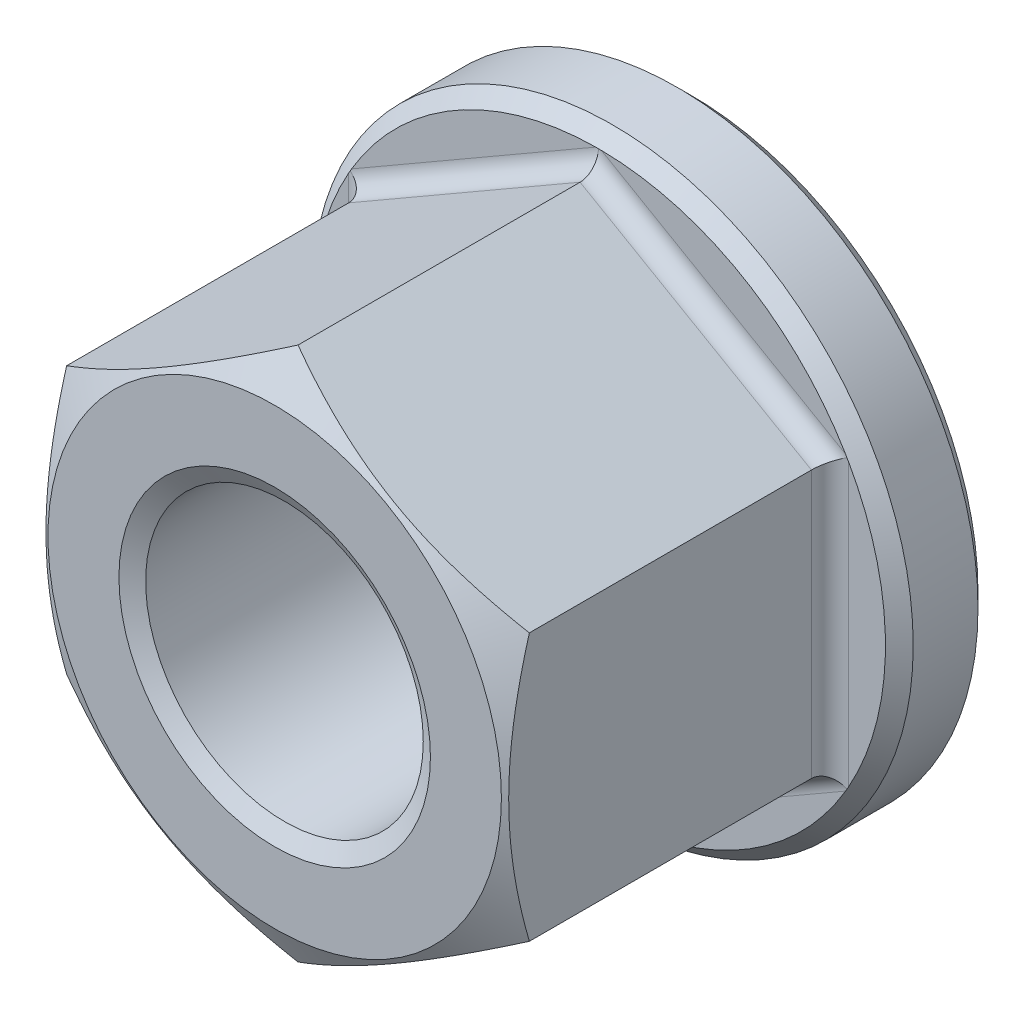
ISO-10303-21;
HEADER;
FILE_DESCRIPTION(('STEP AP214'),'2;1');
FILE_NAME('part.step','',(''),(''),'','','');
FILE_SCHEMA(('AUTOMOTIVE_DESIGN { 1 0 10303 214 1 1 1 1 }'));
ENDSEC;
DATA;
#1=APPLICATION_CONTEXT('core data for automotive mechanical design processes');
#2=APPLICATION_PROTOCOL_DEFINITION('international standard','automotive_design',2000,#1);
#3=PRODUCT_CONTEXT('',#1,'mechanical');
#4=PRODUCT('Part','Part','',(#3));
#5=PRODUCT_RELATED_PRODUCT_CATEGORY('part','',(#4));
#6=PRODUCT_DEFINITION_FORMATION('','',#4);
#7=PRODUCT_DEFINITION_CONTEXT('part definition',#1,'design');
#8=PRODUCT_DEFINITION('design','',#6,#7);
#9=PRODUCT_DEFINITION_SHAPE('','',#8);
#10=(LENGTH_UNIT() NAMED_UNIT(*) SI_UNIT(.MILLI.,.METRE.));
#11=(NAMED_UNIT(*) PLANE_ANGLE_UNIT() SI_UNIT($,.RADIAN.));
#12=(NAMED_UNIT(*) SI_UNIT($,.STERADIAN.) SOLID_ANGLE_UNIT());
#13=UNCERTAINTY_MEASURE_WITH_UNIT(LENGTH_MEASURE(1.E-05),#10,'distance_accuracy_value','');
#14=(GEOMETRIC_REPRESENTATION_CONTEXT(3) GLOBAL_UNCERTAINTY_ASSIGNED_CONTEXT((#13)) GLOBAL_UNIT_ASSIGNED_CONTEXT((#10,
#11,#12)) REPRESENTATION_CONTEXT('',''));
#15=CARTESIAN_POINT('',(0.,0.,0.));
#16=DIRECTION('',(0.,0.,1.));
#17=DIRECTION('',(1.,0.,0.));
#18=AXIS2_PLACEMENT_3D('',#15,#16,#17);
#19=CARTESIAN_POINT('',(0.,0.,2.));
#20=DIRECTION('',(0.,0.,1.));
#21=DIRECTION('',(1.,0.,0.));
#22=AXIS2_PLACEMENT_3D('',#19,#20,#21);
#23=PLANE('',#22);
#24=CARTESIAN_POINT('',(0.,0.,2.));
#25=DIRECTION('',(0.,0.,1.));
#26=DIRECTION('',(1.,0.,0.));
#27=AXIS2_PLACEMENT_3D('',#24,#25,#26);
#28=CIRCLE('',#27,6.2);
#29=CARTESIAN_POINT('',(-0.06181880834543,6.19969180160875,2.));
#30=VERTEX_POINT('',#29);
#31=CARTESIAN_POINT('',(-5.33818119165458,3.15338255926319,2.));
#32=VERTEX_POINT('',#31);
#33=EDGE_CURVE('E435',#30,#32,#28,.T.);
#34=ORIENTED_EDGE('',*,*,#33,.T.);
#35=DIRECTION('',(-0.866025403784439,-0.5,0.));
#36=VECTOR('',#35,1.);
#37=CARTESIAN_POINT('',(-0.2,6.11991285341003,2.));
#38=LINE('',#37,#36);
#39=EDGE_CURVE('E241',#32,#30,#38,.F.);
#40=ORIENTED_EDGE('',*,*,#39,.T.);
#41=EDGE_LOOP('',(#34,#40));
#42=FACE_BOUND('',#41,.T.);
#43=ADVANCED_FACE('F14',(#42),#23,.T.);
#44=CARTESIAN_POINT('',(5.33818119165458,3.15338255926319,2.));
#45=VERTEX_POINT('',#44);
#46=CARTESIAN_POINT('',(0.061818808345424,6.19969180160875,2.));
#47=VERTEX_POINT('',#46);
#48=EDGE_CURVE('E227',#45,#47,#28,.T.);
#49=ORIENTED_EDGE('',*,*,#48,.T.);
#50=DIRECTION('',(-0.866025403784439,0.5,0.));
#51=VECTOR('',#50,1.);
#52=CARTESIAN_POINT('',(5.2,3.2331615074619,2.));
#53=LINE('',#52,#51);
#54=EDGE_CURVE('E239',#47,#45,#53,.F.);
#55=ORIENTED_EDGE('',*,*,#54,.T.);
#56=EDGE_LOOP('',(#49,#55));
#57=FACE_BOUND('',#56,.T.);
#58=ADVANCED_FACE('F389',(#57),#23,.T.);
#59=CARTESIAN_POINT('',(5.4,-3.04630924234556,2.));
#60=VERTEX_POINT('',#59);
#61=CARTESIAN_POINT('',(5.4,3.04630924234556,2.));
#62=VERTEX_POINT('',#61);
#63=EDGE_CURVE('E223',#60,#62,#28,.T.);
#64=ORIENTED_EDGE('',*,*,#63,.T.);
#65=DIRECTION('',(0.,1.,0.));
#66=VECTOR('',#65,1.);
#67=CARTESIAN_POINT('',(5.4,-2.88675134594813,2.));
#68=LINE('',#67,#66);
#69=EDGE_CURVE('E237',#62,#60,#68,.F.);
#70=ORIENTED_EDGE('',*,*,#69,.T.);
#71=EDGE_LOOP('',(#64,#70));
#72=FACE_BOUND('',#71,.T.);
#73=ADVANCED_FACE('F394',(#72),#23,.T.);
#74=CARTESIAN_POINT('',(0.061818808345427,-6.19969180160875,2.));
#75=VERTEX_POINT('',#74);
#76=CARTESIAN_POINT('',(5.33818119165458,-3.15338255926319,2.));
#77=VERTEX_POINT('',#76);
#78=EDGE_CURVE('E226',#75,#77,#28,.T.);
#79=ORIENTED_EDGE('',*,*,#78,.T.);
#80=DIRECTION('',(0.866025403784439,0.5,0.));
#81=VECTOR('',#80,1.);
#82=CARTESIAN_POINT('',(0.2,-6.11991285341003,2.));
#83=LINE('',#82,#81);
#84=EDGE_CURVE('E235',#77,#75,#83,.F.);
#85=ORIENTED_EDGE('',*,*,#84,.T.);
#86=EDGE_LOOP('',(#79,#85));
#87=FACE_BOUND('',#86,.T.);
#88=ADVANCED_FACE('F409',(#87),#23,.T.);
#89=CARTESIAN_POINT('',(-5.33818119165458,-3.15338255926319,2.));
#90=VERTEX_POINT('',#89);
#91=CARTESIAN_POINT('',(-0.0618188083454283,-6.19969180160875,2.));
#92=VERTEX_POINT('',#91);
#93=EDGE_CURVE('E416',#90,#92,#28,.T.);
#94=ORIENTED_EDGE('',*,*,#93,.T.);
#95=DIRECTION('',(0.866025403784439,-0.5,0.));
#96=VECTOR('',#95,1.);
#97=CARTESIAN_POINT('',(-5.2,-3.2331615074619,2.));
#98=LINE('',#97,#96);
#99=EDGE_CURVE('E233',#92,#90,#98,.F.);
#100=ORIENTED_EDGE('',*,*,#99,.T.);
#101=EDGE_LOOP('',(#94,#100));
#102=FACE_BOUND('',#101,.T.);
#103=ADVANCED_FACE('F190',(#102),#23,.T.);
#104=CARTESIAN_POINT('',(-5.,-2.88675134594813,2.));
#105=DIRECTION('',(-0.5,-0.866025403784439,0.));
#106=DIRECTION('',(0.866025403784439,-0.5,0.));
#107=AXIS2_PLACEMENT_3D('',#104,#105,#106);
#108=PLANE('',#107);
#109=DIRECTION('',(0.,0.,1.));
#110=VECTOR('',#109,1.);
#111=CARTESIAN_POINT('',(-5.,-2.88675134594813,2.));
#112=LINE('',#111,#110);
#113=CARTESIAN_POINT('',(-5.,-2.88675134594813,2.4));
#114=VERTEX_POINT('',#113);
#115=CARTESIAN_POINT('',(-5.,-2.88675134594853,8.4956829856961));
#116=VERTEX_POINT('',#115);
#117=EDGE_CURVE('E206',#114,#116,#112,.T.);
#118=ORIENTED_EDGE('',*,*,#117,.F.);
#119=DIRECTION('',(0.866025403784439,-0.5,0.));
#120=VECTOR('',#119,1.);
#121=CARTESIAN_POINT('',(0.,-5.77350269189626,2.4));
#122=LINE('',#121,#120);
#123=CARTESIAN_POINT('',(0.,-5.77350269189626,2.4));
#124=VERTEX_POINT('',#123);
#125=EDGE_CURVE('E249',#114,#124,#122,.T.);
#126=ORIENTED_EDGE('',*,*,#125,.T.);
#127=DIRECTION('',(0.,0.,1.));
#128=VECTOR('',#127,1.);
#129=CARTESIAN_POINT('',(0.,-5.77350269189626,2.));
#130=LINE('',#129,#128);
#131=CARTESIAN_POINT('',(0.,-5.77350269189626,8.49568298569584));
#132=VERTEX_POINT('',#131);
#133=EDGE_CURVE('E134',#124,#132,#130,.T.);
#134=ORIENTED_EDGE('',*,*,#133,.T.);
#135=CARTESIAN_POINT('',(0.0002,-5.7736181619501,8.49561631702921));
#136=CARTESIAN_POINT('',(-0.219534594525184,-5.64675433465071,8.5688784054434));
#137=CARTESIAN_POINT('',(-0.441148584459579,-5.5188054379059,8.63551365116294));
#138=CARTESIAN_POINT('',(-0.888213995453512,-5.26069210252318,8.75182598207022));
#139=CARTESIAN_POINT('',(-1.11367335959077,-5.13052307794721,8.80146192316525));
#140=CARTESIAN_POINT('',(-1.56183230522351,-4.87177839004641,8.87871394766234));
#141=CARTESIAN_POINT('',(-1.78446209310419,-4.74324302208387,8.90684459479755));
#142=CARTESIAN_POINT('',(-2.11918990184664,-4.54998783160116,8.93207005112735));
#143=CARTESIAN_POINT('',(-2.23084219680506,-4.48552534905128,8.93765151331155));
#144=CARTESIAN_POINT('',(-2.4542499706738,-4.35654081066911,8.94306275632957));
#145=CARTESIAN_POINT('',(-2.56600544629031,-4.2920187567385,8.94289271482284));
#146=CARTESIAN_POINT('',(-2.87218423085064,-4.11524635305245,8.93451134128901));
#147=CARTESIAN_POINT('',(-3.06650608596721,-4.00305457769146,8.92043520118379));
#148=CARTESIAN_POINT('',(-3.4538601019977,-3.77941563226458,8.8757997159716));
#149=CARTESIAN_POINT('',(-3.64689090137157,-3.66796924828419,8.84522511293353));
#150=CARTESIAN_POINT('',(-4.03502534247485,-3.44387972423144,8.76879647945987));
#151=CARTESIAN_POINT('',(-4.23007999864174,-3.3312648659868,8.72261859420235));
#152=CARTESIAN_POINT('',(-4.61728034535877,-3.10771464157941,8.6178131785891));
#153=CARTESIAN_POINT('',(-4.80943099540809,-2.99677641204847,8.55921026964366));
#154=CARTESIAN_POINT('',(-5.0002,-2.88663587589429,8.49561631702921));
#155=B_SPLINE_CURVE_WITH_KNOTS('',3,(#135,#136,#137,#138,#139,#140,#141,#142,#143,#144,#145,
#146,#147,#148,#149,#150,#151,#152,#153,#154),.UNSPECIFIED.,.F.,.F.,(4,2,2,2,2,2,2,2,2,4),(0.,
0.792555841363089,1.58701660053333,2.3618153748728,2.74884076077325,3.13585419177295,
3.80962362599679,4.48401723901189,5.17336882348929,5.86136694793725),.UNSPECIFIED.);
#156=EDGE_CURVE('E146',#132,#116,#155,.T.);
#157=ORIENTED_EDGE('',*,*,#156,.T.);
#158=EDGE_LOOP('',(#118,#126,#134,#157));
#159=FACE_BOUND('',#158,.T.);
#160=ADVANCED_FACE('F185',(#159),#108,.T.);
#161=CARTESIAN_POINT('',(-5.,2.88675134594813,2.));
#162=DIRECTION('',(-1.,0.,0.));
#163=DIRECTION('',(0.,-1.,0.));
#164=AXIS2_PLACEMENT_3D('',#161,#162,#163);
#165=PLANE('',#164);
#166=DIRECTION('',(0.,0.,1.));
#167=VECTOR('',#166,1.);
#168=CARTESIAN_POINT('',(-5.,2.88675134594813,2.));
#169=LINE('',#168,#167);
#170=CARTESIAN_POINT('',(-5.,2.88675134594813,2.4));
#171=VERTEX_POINT('',#170);
#172=CARTESIAN_POINT('',(-5.,2.88675134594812,8.49568298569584));
#173=VERTEX_POINT('',#172);
#174=EDGE_CURVE('E209',#171,#173,#169,.T.);
#175=ORIENTED_EDGE('',*,*,#174,.F.);
#176=DIRECTION('',(0.,-1.,0.));
#177=VECTOR('',#176,1.);
#178=CARTESIAN_POINT('',(-5.,-2.88675134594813,2.4));
#179=LINE('',#178,#177);
#180=EDGE_CURVE('E251',#171,#114,#179,.T.);
#181=ORIENTED_EDGE('',*,*,#180,.T.);
#182=ORIENTED_EDGE('',*,*,#117,.T.);
#183=CARTESIAN_POINT('',(-5.,-7.82209146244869,6.46913090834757));
#184=CARTESIAN_POINT('',(-5.,-7.60302075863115,6.57567124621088));
#185=CARTESIAN_POINT('',(-5.,-7.38345417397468,6.68120907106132));
#186=CARTESIAN_POINT('',(-5.,-6.94306557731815,6.88971681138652));
#187=CARTESIAN_POINT('',(-5.,-6.72224337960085,6.99268633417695));
#188=CARTESIAN_POINT('',(-5.,-6.27797580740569,7.19599752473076));
#189=CARTESIAN_POINT('',(-5.,-6.05452273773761,7.29632243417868));
#190=CARTESIAN_POINT('',(-5.,-5.60586166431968,7.49295297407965));
#191=CARTESIAN_POINT('',(-5.,-5.38065374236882,7.58925879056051));
#192=CARTESIAN_POINT('',(-5.,-4.92082539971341,7.77981642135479));
#193=CARTESIAN_POINT('',(-5.,-4.68613565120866,7.87390183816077));
#194=CARTESIAN_POINT('',(-5.,-4.2140362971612,8.05511489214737));
#195=CARTESIAN_POINT('',(-5.,-3.97662639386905,8.14224175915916));
#196=CARTESIAN_POINT('',(-5.,-3.49913065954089,8.30730182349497));
#197=CARTESIAN_POINT('',(-5.,-3.25905110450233,8.38525299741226));
#198=CARTESIAN_POINT('',(-5.,-2.77544998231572,8.52950636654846));
#199=CARTESIAN_POINT('',(-5.,-2.53192950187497,8.5958121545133));
#200=CARTESIAN_POINT('',(-5.,-2.04256062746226,8.71331092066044));
#201=CARTESIAN_POINT('',(-5.,-1.79673124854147,8.76458165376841));
#202=CARTESIAN_POINT('',(-5.,-1.30194800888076,8.84911994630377));
#203=CARTESIAN_POINT('',(-5.,-1.05299450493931,8.88238954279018));
#204=CARTESIAN_POINT('',(-5.,-0.556478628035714,8.92784034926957));
#205=CARTESIAN_POINT('',(-5.,-0.308942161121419,8.94029757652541));
#206=CARTESIAN_POINT('',(-5.,0.186312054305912,8.94379827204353));
#207=CARTESIAN_POINT('',(-5.,0.434029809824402,8.93484086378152));
#208=CARTESIAN_POINT('',(-5.,0.852416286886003,8.90226697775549));
#209=CARTESIAN_POINT('',(-5.,1.02352505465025,8.88395911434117));
#210=CARTESIAN_POINT('',(-5.,1.36452805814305,8.8382276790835));
#211=CARTESIAN_POINT('',(-5.,1.53442213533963,8.81080293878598));
#212=CARTESIAN_POINT('',(-5.,2.0420162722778,8.71629201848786));
#213=CARTESIAN_POINT('',(-5.,2.37746798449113,8.63698330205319));
#214=CARTESIAN_POINT('',(-5.,2.87949597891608,8.49889569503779));
#215=CARTESIAN_POINT('',(-5.,3.0486539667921,8.44896493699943));
#216=CARTESIAN_POINT('',(-5.,3.38532627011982,8.34379029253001));
#217=CARTESIAN_POINT('',(-5.,3.55284057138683,8.2885463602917));
#218=CARTESIAN_POINT('',(-5.,3.88628314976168,8.17364114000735));
#219=CARTESIAN_POINT('',(-5.,4.05221183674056,8.11398103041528));
#220=CARTESIAN_POINT('',(-5.,4.38268193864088,7.99096321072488));
#221=CARTESIAN_POINT('',(-5.,4.54722340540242,7.92760563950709));
#222=CARTESIAN_POINT('',(-5.,4.88819461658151,7.79260570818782));
#223=CARTESIAN_POINT('',(-5.,5.06452219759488,7.72070607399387));
#224=CARTESIAN_POINT('',(-5.,5.4159306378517,7.5739163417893));
#225=CARTESIAN_POINT('',(-5.,5.5910114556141,7.4990261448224));
#226=CARTESIAN_POINT('',(-5.,6.11468260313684,7.27062534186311));
#227=CARTESIAN_POINT('',(-5.,6.46165394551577,7.11340373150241));
#228=CARTESIAN_POINT('',(-5.,7.1525402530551,6.7919150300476));
#229=CARTESIAN_POINT('',(-5.,7.49645327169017,6.62764379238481));
#230=CARTESIAN_POINT('',(-5.,8.18178186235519,6.29404780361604));
#231=CARTESIAN_POINT('',(-5.,8.52319761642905,6.12472342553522));
#232=CARTESIAN_POINT('',(-5.,9.20486118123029,5.78193952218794));
#233=CARTESIAN_POINT('',(-5.,9.54510490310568,5.6084718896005));
#234=CARTESIAN_POINT('',(-5.,10.2241114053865,5.2586536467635));
#235=CARTESIAN_POINT('',(-5.,10.5628741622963,5.0823029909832));
#236=CARTESIAN_POINT('',(-5.,11.2391084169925,4.7274271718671));
#237=CARTESIAN_POINT('',(-5.,11.5765803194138,4.54890277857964));
#238=CARTESIAN_POINT('',(-5.,12.2505828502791,4.19008493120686));
#239=CARTESIAN_POINT('',(-5.,12.5871134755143,4.00979147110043));
#240=CARTESIAN_POINT('',(-5.,13.5053258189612,3.51538301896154));
#241=CARTESIAN_POINT('',(-5.,14.0862479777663,3.1998578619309));
#242=CARTESIAN_POINT('',(-5.,15.246520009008,2.56579951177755));
#243=CARTESIAN_POINT('',(-5.,15.8258697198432,2.24726602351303));
#244=CARTESIAN_POINT('',(-5.,16.9810283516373,1.60931412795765));
#245=CARTESIAN_POINT('',(-5.,17.5568421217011,1.28990449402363));
#246=CARTESIAN_POINT('',(-5.,18.7074829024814,0.649462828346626));
#247=CARTESIAN_POINT('',(-5.,19.2823100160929,0.328430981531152));
#248=CARTESIAN_POINT('',(-5.,19.856811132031,0.00682041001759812));
#249=B_SPLINE_CURVE_WITH_KNOTS('',3,(#183,#184,#185,#186,#187,#188,#189,#190,#191,#192,#193,
#194,#195,#196,#197,#198,#199,#200,#201,#202,#203,#204,#205,#206,#207,#208,#209,#210,#211,#212,
#213,#214,#215,#216,#217,#218,#219,#220,#221,#222,#223,#224,#225,#226,#227,#228,#229,#230,#231,
#232,#233,#234,#235,#236,#237,#238,#239,#240,#241,#242,#243,#244,#245,#246,#247,#248),
.UNSPECIFIED.,.F.,.F.,(4,2,2,2,2,2,2,2,2,2,2,2,2,2,2,2,2,2,2,2,2,2,2,2,2,2,2,2,2,2,2,2,4),(0.,
0.730820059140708,1.46175118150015,2.19654410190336,2.9313029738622,3.68975709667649,
4.44829504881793,5.20532126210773,5.96211351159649,6.71491999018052,7.46764126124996,
8.21029817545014,8.95298548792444,9.46899318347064,9.98506703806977,11.0176951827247,
11.5467678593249,12.0758450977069,12.6047816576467,13.1336983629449,13.7049342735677,
14.276189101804,15.4188529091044,16.5621982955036,17.7054594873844,18.8511785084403,
19.9969156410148,21.1422580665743,22.2876043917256,24.2708301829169,26.2542526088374,
28.2296624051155,30.2048518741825),.UNSPECIFIED.);
#250=EDGE_CURVE('E201',#116,#173,#249,.T.);
#251=ORIENTED_EDGE('',*,*,#250,.T.);
#252=EDGE_LOOP('',(#175,#181,#182,#251));
#253=FACE_BOUND('',#252,.T.);
#254=ADVANCED_FACE('F189',(#253),#165,.T.);
#255=CARTESIAN_POINT('',(0.,5.77350269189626,2.));
#256=DIRECTION('',(-0.5,0.866025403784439,0.));
#257=DIRECTION('',(-0.866025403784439,-0.5,0.));
#258=AXIS2_PLACEMENT_3D('',#255,#256,#257);
#259=PLANE('',#258);
#260=DIRECTION('',(0.,0.,1.));
#261=VECTOR('',#260,1.);
#262=CARTESIAN_POINT('',(0.,5.77350269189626,2.));
#263=LINE('',#262,#261);
#264=CARTESIAN_POINT('',(0.,5.77350269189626,2.4));
#265=VERTEX_POINT('',#264);
#266=CARTESIAN_POINT('',(0.,5.77350269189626,8.49568298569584));
#267=VERTEX_POINT('',#266);
#268=EDGE_CURVE('E211',#265,#267,#263,.T.);
#269=ORIENTED_EDGE('',*,*,#268,.F.);
#270=DIRECTION('',(-0.866025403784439,-0.5,0.));
#271=VECTOR('',#270,1.);
#272=CARTESIAN_POINT('',(-5.,2.88675134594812,2.4));
#273=LINE('',#272,#271);
#274=EDGE_CURVE('E228',#265,#171,#273,.T.);
#275=ORIENTED_EDGE('',*,*,#274,.T.);
#276=ORIENTED_EDGE('',*,*,#174,.T.);
#277=CARTESIAN_POINT('',(-5.0002,2.88663587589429,8.49561631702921));
#278=CARTESIAN_POINT('',(-4.78046540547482,3.01349970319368,8.5688784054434));
#279=CARTESIAN_POINT('',(-4.55885141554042,3.14144859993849,8.63551365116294));
#280=CARTESIAN_POINT('',(-4.11178600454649,3.39956193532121,8.75182598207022));
#281=CARTESIAN_POINT('',(-3.88632664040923,3.52973095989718,8.80146192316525));
#282=CARTESIAN_POINT('',(-3.43816769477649,3.78847564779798,8.87871394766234));
#283=CARTESIAN_POINT('',(-3.21553790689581,3.91701101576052,8.90684459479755));
#284=CARTESIAN_POINT('',(-2.88081009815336,4.11026620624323,8.93207005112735));
#285=CARTESIAN_POINT('',(-2.76915780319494,4.17472868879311,8.93765151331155));
#286=CARTESIAN_POINT('',(-2.5457500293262,4.30371322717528,8.94306275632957));
#287=CARTESIAN_POINT('',(-2.43399455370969,4.36823528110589,8.94289271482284));
#288=CARTESIAN_POINT('',(-2.12781576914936,4.54500768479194,8.93451134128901));
#289=CARTESIAN_POINT('',(-1.93349391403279,4.65719946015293,8.92043520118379));
#290=CARTESIAN_POINT('',(-1.5461398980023,4.88083840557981,8.8757997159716));
#291=CARTESIAN_POINT('',(-1.35310909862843,4.9922847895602,8.84522511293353));
#292=CARTESIAN_POINT('',(-0.964974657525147,5.21637431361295,8.76879647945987));
#293=CARTESIAN_POINT('',(-0.769920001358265,5.32898917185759,8.72261859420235));
#294=CARTESIAN_POINT('',(-0.382719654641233,5.55253939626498,8.6178131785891));
#295=CARTESIAN_POINT('',(-0.190569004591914,5.66347762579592,8.55921026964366));
#296=CARTESIAN_POINT('',(0.000199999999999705,5.7736181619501,8.49561631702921));
#297=B_SPLINE_CURVE_WITH_KNOTS('',3,(#277,#278,#279,#280,#281,#282,#283,#284,#285,#286,#287,
#288,#289,#290,#291,#292,#293,#294,#295,#296),.UNSPECIFIED.,.F.,.F.,(4,2,2,2,2,2,2,2,2,4),(0.,
0.79255584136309,1.58701660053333,2.3618153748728,2.74884076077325,3.13585419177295,
3.80962362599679,4.48401723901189,5.17336882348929,5.86136694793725),.UNSPECIFIED.);
#298=EDGE_CURVE('E153',#173,#267,#297,.T.);
#299=ORIENTED_EDGE('',*,*,#298,.T.);
#300=EDGE_LOOP('',(#269,#275,#276,#299));
#301=FACE_BOUND('',#300,.T.);
#302=ADVANCED_FACE('F507',(#301),#259,.T.);
#303=CARTESIAN_POINT('',(5.,2.88675134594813,2.));
#304=DIRECTION('',(0.5,0.866025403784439,0.));
#305=DIRECTION('',(-0.866025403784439,0.5,0.));
#306=AXIS2_PLACEMENT_3D('',#303,#304,#305);
#307=PLANE('',#306);
#308=DIRECTION('',(0.,0.,1.));
#309=VECTOR('',#308,1.);
#310=CARTESIAN_POINT('',(5.,2.88675134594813,2.));
#311=LINE('',#310,#309);
#312=CARTESIAN_POINT('',(5.,2.88675134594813,2.4));
#313=VERTEX_POINT('',#312);
#314=CARTESIAN_POINT('',(5.,2.88675134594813,8.49568298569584));
#315=VERTEX_POINT('',#314);
#316=EDGE_CURVE('E133',#313,#315,#311,.T.);
#317=ORIENTED_EDGE('',*,*,#316,.F.);
#318=DIRECTION('',(-0.866025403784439,0.5,0.));
#319=VECTOR('',#318,1.);
#320=CARTESIAN_POINT('',(0.,5.77350269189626,2.4));
#321=LINE('',#320,#319);
#322=EDGE_CURVE('E244',#313,#265,#321,.T.);
#323=ORIENTED_EDGE('',*,*,#322,.T.);
#324=ORIENTED_EDGE('',*,*,#268,.T.);
#325=CARTESIAN_POINT('',(-0.000200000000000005,5.7736181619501,8.49561631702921));
#326=CARTESIAN_POINT('',(0.219534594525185,5.64675433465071,8.5688784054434));
#327=CARTESIAN_POINT('',(0.441148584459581,5.5188054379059,8.63551365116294));
#328=CARTESIAN_POINT('',(0.888213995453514,5.26069210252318,8.75182598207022));
#329=CARTESIAN_POINT('',(1.11367335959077,5.13052307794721,8.80146192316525));
#330=CARTESIAN_POINT('',(1.56183230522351,4.87177839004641,8.87871394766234));
#331=CARTESIAN_POINT('',(1.78446209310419,4.74324302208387,8.90684459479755));
#332=CARTESIAN_POINT('',(2.11918990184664,4.54998783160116,8.93207005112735));
#333=CARTESIAN_POINT('',(2.23084219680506,4.48552534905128,8.93765151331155));
#334=CARTESIAN_POINT('',(2.4542499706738,4.35654081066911,8.94306275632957));
#335=CARTESIAN_POINT('',(2.56600544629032,4.2920187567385,8.94289271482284));
#336=CARTESIAN_POINT('',(2.87218423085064,4.11524635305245,8.93451134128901));
#337=CARTESIAN_POINT('',(3.06650608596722,4.00305457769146,8.92043520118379));
#338=CARTESIAN_POINT('',(3.45386010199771,3.77941563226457,8.8757997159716));
#339=CARTESIAN_POINT('',(3.64689090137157,3.66796924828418,8.84522511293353));
#340=CARTESIAN_POINT('',(4.03502534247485,3.44387972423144,8.76879647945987));
#341=CARTESIAN_POINT('',(4.23007999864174,3.3312648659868,8.72261859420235));
#342=CARTESIAN_POINT('',(4.61728034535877,3.10771464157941,8.6178131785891));
#343=CARTESIAN_POINT('',(4.80943099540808,2.99677641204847,8.55921026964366));
#344=CARTESIAN_POINT('',(5.0002,2.88663587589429,8.49561631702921));
#345=B_SPLINE_CURVE_WITH_KNOTS('',3,(#325,#326,#327,#328,#329,#330,#331,#332,#333,#334,#335,
#336,#337,#338,#339,#340,#341,#342,#343,#344),.UNSPECIFIED.,.F.,.F.,(4,2,2,2,2,2,2,2,2,4),(0.,
0.792555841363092,1.58701660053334,2.36181537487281,2.74884076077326,3.13585419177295,
3.80962362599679,4.48401723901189,5.17336882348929,5.86136694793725),.UNSPECIFIED.);
#346=EDGE_CURVE('E151',#267,#315,#345,.T.);
#347=ORIENTED_EDGE('',*,*,#346,.T.);
#348=EDGE_LOOP('',(#317,#323,#324,#347));
#349=FACE_BOUND('',#348,.T.);
#350=ADVANCED_FACE('F178',(#349),#307,.T.);
#351=CARTESIAN_POINT('',(5.,-2.88675134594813,2.));
#352=DIRECTION('',(1.,0.,0.));
#353=DIRECTION('',(0.,1.,0.));
#354=AXIS2_PLACEMENT_3D('',#351,#352,#353);
#355=PLANE('',#354);
#356=DIRECTION('',(0.,0.,1.));
#357=VECTOR('',#356,1.);
#358=CARTESIAN_POINT('',(5.,-2.88675134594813,2.));
#359=LINE('',#358,#357);
#360=CARTESIAN_POINT('',(5.,-2.88675134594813,2.4));
#361=VERTEX_POINT('',#360);
#362=CARTESIAN_POINT('',(5.,-2.88675134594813,8.49568298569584));
#363=VERTEX_POINT('',#362);
#364=EDGE_CURVE('E123',#361,#363,#359,.T.);
#365=ORIENTED_EDGE('',*,*,#364,.F.);
#366=DIRECTION('',(0.,1.,0.));
#367=VECTOR('',#366,1.);
#368=CARTESIAN_POINT('',(5.,2.88675134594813,2.4));
#369=LINE('',#368,#367);
#370=EDGE_CURVE('E246',#361,#313,#369,.T.);
#371=ORIENTED_EDGE('',*,*,#370,.T.);
#372=ORIENTED_EDGE('',*,*,#316,.T.);
#373=CARTESIAN_POINT('',(5.,-7.82209146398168,6.46913090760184));
#374=CARTESIAN_POINT('',(5.,-7.60302076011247,6.57567124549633));
#375=CARTESIAN_POINT('',(5.,-7.3834541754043,6.68120907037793));
#376=CARTESIAN_POINT('',(5.,-6.94306557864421,6.8897168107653));
#377=CARTESIAN_POINT('',(5.,-6.72224338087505,6.99268633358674));
#378=CARTESIAN_POINT('',(5.,-6.27797580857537,7.19599752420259));
#379=CARTESIAN_POINT('',(5.,-6.05452273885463,7.29632243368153));
#380=CARTESIAN_POINT('',(5.,-5.60586166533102,7.49295297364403));
#381=CARTESIAN_POINT('',(5.,-5.38065374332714,7.5892587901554));
#382=CARTESIAN_POINT('',(5.,-4.92082540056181,7.77981642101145));
#383=CARTESIAN_POINT('',(5.,-4.68613565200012,7.87390183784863));
#384=CARTESIAN_POINT('',(5.,-4.21403629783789,8.05511489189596));
#385=CARTESIAN_POINT('',(5.,-3.9766263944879,8.14224175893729));
#386=CARTESIAN_POINT('',(5.,-3.49913066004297,8.30730182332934));
#387=CARTESIAN_POINT('',(5.,-3.25905110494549,8.38525299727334));
#388=CARTESIAN_POINT('',(5.,-2.77544998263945,8.52950636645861));
#389=CARTESIAN_POINT('',(5.,-2.53192950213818,8.5958121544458));
#390=CARTESIAN_POINT('',(5.,-2.04256062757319,8.71331092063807));
#391=CARTESIAN_POINT('',(5.,-1.79673124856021,8.76458165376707));
#392=CARTESIAN_POINT('',(5.,-1.30194800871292,8.84911994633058));
#393=CARTESIAN_POINT('',(5.,-1.05299450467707,8.88238954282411));
#394=CARTESIAN_POINT('',(5.,-0.556478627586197,8.92784034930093));
#395=CARTESIAN_POINT('',(5.,-0.30894216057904,8.94029757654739));
#396=CARTESIAN_POINT('',(5.,0.18631205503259,8.94379827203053));
#397=CARTESIAN_POINT('',(5.,0.434029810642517,8.93484086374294));
#398=CARTESIAN_POINT('',(5.,0.852416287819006,8.90226697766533));
#399=CARTESIAN_POINT('',(5.,1.02352505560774,8.88395911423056));
#400=CARTESIAN_POINT('',(5.,1.36452805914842,8.8382276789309));
#401=CARTESIAN_POINT('',(5.,1.53442213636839,8.81080293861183));
#402=CARTESIAN_POINT('',(5.,2.04201627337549,8.71629201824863));
#403=CARTESIAN_POINT('',(5.,2.37746798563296,8.63698330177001));
#404=CARTESIAN_POINT('',(5.,2.87949598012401,8.4988956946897));
#405=CARTESIAN_POINT('',(5.,3.04865396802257,8.44896493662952));
#406=CARTESIAN_POINT('',(5.,3.38532627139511,8.34379029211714));
#407=CARTESIAN_POINT('',(5.,3.55284057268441,8.28854635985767));
#408=CARTESIAN_POINT('',(5.,3.88628315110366,8.17364113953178));
#409=CARTESIAN_POINT('',(5.,4.05221183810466,8.11398102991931));
#410=CARTESIAN_POINT('',(5.,4.38268194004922,7.99096321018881));
#411=CARTESIAN_POINT('',(5.,4.54722340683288,7.92760563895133));
#412=CARTESIAN_POINT('',(5.,4.88819461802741,7.7926057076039));
#413=CARTESIAN_POINT('',(5.,5.06452219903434,7.72070607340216));
#414=CARTESIAN_POINT('',(5.,5.41593063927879,7.57391634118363));
#415=CARTESIAN_POINT('',(5.,5.59101145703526,7.49902614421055));
#416=CARTESIAN_POINT('',(5.,6.11468260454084,7.27062534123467));
#417=CARTESIAN_POINT('',(5.,6.46165394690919,7.11340373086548));
#418=CARTESIAN_POINT('',(5.,7.1525402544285,6.79191502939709));
#419=CARTESIAN_POINT('',(5.,7.49645327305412,6.62764379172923));
#420=CARTESIAN_POINT('',(5.,8.18178186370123,6.2940478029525));
#421=CARTESIAN_POINT('',(5.,8.52319761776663,6.12472342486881));
#422=CARTESIAN_POINT('',(5.,9.204861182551,5.7819395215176));
#423=CARTESIAN_POINT('',(5.,9.54510490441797,5.60847188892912));
#424=CARTESIAN_POINT('',(5.,10.2241114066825,5.25865364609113));
#425=CARTESIAN_POINT('',(5.,10.5628741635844,5.08230299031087));
#426=CARTESIAN_POINT('',(5.,11.2391084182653,4.72742717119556));
#427=CARTESIAN_POINT('',(5.,11.5765803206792,4.54890277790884));
#428=CARTESIAN_POINT('',(5.,12.2505828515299,4.19008493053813));
#429=CARTESIAN_POINT('',(5.,12.587113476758,4.009791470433));
#430=CARTESIAN_POINT('',(5.,13.5053258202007,3.51538301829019));
#431=CARTESIAN_POINT('',(4.99999999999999,14.086247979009,3.19985786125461));
#432=CARTESIAN_POINT('',(4.99999999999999,15.2465200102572,2.56579951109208));
#433=CARTESIAN_POINT('',(4.99999999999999,15.8258697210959,2.24726602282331));
#434=CARTESIAN_POINT('',(4.99999999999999,16.981028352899,1.60931412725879));
#435=CARTESIAN_POINT('',(4.99999999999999,17.5568421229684,1.28990449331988));
#436=CARTESIAN_POINT('',(4.99999999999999,18.7074829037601,0.649462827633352));
#437=CARTESIAN_POINT('',(5.,19.2823100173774,0.328430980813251));
#438=CARTESIAN_POINT('',(5.,19.8568111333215,0.00682040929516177));
#439=B_SPLINE_CURVE_WITH_KNOTS('',3,(#373,#374,#375,#376,#377,#378,#379,#380,#381,#382,#383,
#384,#385,#386,#387,#388,#389,#390,#391,#392,#393,#394,#395,#396,#397,#398,#399,#400,#401,#402,
#403,#404,#405,#406,#407,#408,#409,#410,#411,#412,#413,#414,#415,#416,#417,#418,#419,#420,#421,
#422,#423,#424,#425,#426,#427,#428,#429,#430,#431,#432,#433,#434,#435,#436,#437,#438),
.UNSPECIFIED.,.F.,.F.,(4,2,2,2,2,2,2,2,2,2,2,2,2,2,2,2,2,2,2,2,2,2,2,2,2,2,2,2,2,2,2,2,4),(0.,
0.730820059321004,1.46175118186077,2.19654410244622,2.93130297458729,3.68975709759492,
4.44829504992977,5.20532126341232,5.96211351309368,6.71491999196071,7.46764126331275,
8.21029817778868,8.95298549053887,9.46899318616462,9.98506704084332,11.0176951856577,
11.5467678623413,12.0758451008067,12.6047816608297,13.1336983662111,13.7049342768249,
14.2761891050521,15.4188529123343,16.5621982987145,17.7054594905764,18.8511785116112,
19.9969156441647,21.1422580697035,22.2876043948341,24.2708301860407,26.2542526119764,
28.2296624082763,30.2048518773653),.UNSPECIFIED.);
#440=EDGE_CURVE('E142',#315,#363,#439,.F.);
#441=ORIENTED_EDGE('',*,*,#440,.T.);
#442=EDGE_LOOP('',(#365,#371,#372,#441));
#443=FACE_BOUND('',#442,.T.);
#444=ADVANCED_FACE('F149',(#443),#355,.T.);
#445=CARTESIAN_POINT('',(0.,-5.77350269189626,2.));
#446=DIRECTION('',(0.5,-0.866025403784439,0.));
#447=DIRECTION('',(0.866025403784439,0.5,0.));
#448=AXIS2_PLACEMENT_3D('',#445,#446,#447);
#449=PLANE('',#448);
#450=ORIENTED_EDGE('',*,*,#133,.F.);
#451=DIRECTION('',(0.866025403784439,0.5,0.));
#452=VECTOR('',#451,1.);
#453=CARTESIAN_POINT('',(5.,-2.88675134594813,2.4));
#454=LINE('',#453,#452);
#455=EDGE_CURVE('E129',#124,#361,#454,.T.);
#456=ORIENTED_EDGE('',*,*,#455,.T.);
#457=ORIENTED_EDGE('',*,*,#364,.T.);
#458=CARTESIAN_POINT('',(5.0002,-2.88663587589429,8.49561631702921));
#459=CARTESIAN_POINT('',(4.78046540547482,-3.01349970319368,8.5688784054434));
#460=CARTESIAN_POINT('',(4.55885141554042,-3.14144859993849,8.63551365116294));
#461=CARTESIAN_POINT('',(4.11178600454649,-3.39956193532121,8.75182598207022));
#462=CARTESIAN_POINT('',(3.88632664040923,-3.52973095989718,8.80146192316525));
#463=CARTESIAN_POINT('',(3.43816769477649,-3.78847564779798,8.87871394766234));
#464=CARTESIAN_POINT('',(3.21553790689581,-3.91701101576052,8.90684459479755));
#465=CARTESIAN_POINT('',(2.88081009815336,-4.11026620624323,8.93207005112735));
#466=CARTESIAN_POINT('',(2.76915780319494,-4.17472868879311,8.93765151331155));
#467=CARTESIAN_POINT('',(2.5457500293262,-4.30371322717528,8.94306275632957));
#468=CARTESIAN_POINT('',(2.43399455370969,-4.36823528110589,8.94289271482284));
#469=CARTESIAN_POINT('',(2.12781576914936,-4.54500768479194,8.93451134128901));
#470=CARTESIAN_POINT('',(1.93349391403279,-4.65719946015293,8.92043520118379));
#471=CARTESIAN_POINT('',(1.5461398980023,-4.88083840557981,8.8757997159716));
#472=CARTESIAN_POINT('',(1.35310909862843,-4.9922847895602,8.84522511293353));
#473=CARTESIAN_POINT('',(0.964974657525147,-5.21637431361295,8.76879647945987));
#474=CARTESIAN_POINT('',(0.769920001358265,-5.32898917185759,8.72261859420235));
#475=CARTESIAN_POINT('',(0.382719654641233,-5.55253939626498,8.6178131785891));
#476=CARTESIAN_POINT('',(0.190569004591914,-5.66347762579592,8.55921026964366));
#477=CARTESIAN_POINT('',(-0.000199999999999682,-5.7736181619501,8.49561631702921));
#478=B_SPLINE_CURVE_WITH_KNOTS('',3,(#458,#459,#460,#461,#462,#463,#464,#465,#466,#467,#468,
#469,#470,#471,#472,#473,#474,#475,#476,#477),.UNSPECIFIED.,.F.,.F.,(4,2,2,2,2,2,2,2,2,4),(0.,
0.79255584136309,1.58701660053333,2.3618153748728,2.74884076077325,3.13585419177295,
3.80962362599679,4.48401723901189,5.17336882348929,5.86136694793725),.UNSPECIFIED.);
#479=EDGE_CURVE('E127',#363,#132,#478,.T.);
#480=ORIENTED_EDGE('',*,*,#479,.T.);
#481=EDGE_LOOP('',(#450,#456,#457,#480));
#482=FACE_BOUND('',#481,.T.);
#483=ADVANCED_FACE('F126',(#482),#449,.T.);
#484=CARTESIAN_POINT('',(0.,0.,9.));
#485=DIRECTION('',(0.,0.,-1.));
#486=DIRECTION('',(-1.,0.,0.));
#487=AXIS2_PLACEMENT_3D('',#484,#485,#486);
#488=CYLINDRICAL_SURFACE('',#487,6.5);
#489=CARTESIAN_POINT('',(0.,0.,0.300000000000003));
#490=DIRECTION('',(0.,0.,1.));
#491=DIRECTION('',(1.,0.,0.));
#492=AXIS2_PLACEMENT_3D('',#489,#490,#491);
#493=CIRCLE('',#492,6.5);
#494=CARTESIAN_POINT('',(6.5,0.,0.300000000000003));
#495=VERTEX_POINT('',#494);
#496=EDGE_CURVE('E217',#495,#495,#493,.T.);
#497=ORIENTED_EDGE('',*,*,#496,.T.);
#498=EDGE_LOOP('',(#497));
#499=FACE_BOUND('',#498,.T.);
#500=CARTESIAN_POINT('',(0.,0.,1.7));
#501=DIRECTION('',(0.,0.,1.));
#502=DIRECTION('',(1.,0.,0.));
#503=AXIS2_PLACEMENT_3D('',#500,#501,#502);
#504=CIRCLE('',#503,6.5);
#505=CARTESIAN_POINT('',(6.5,0.,1.7));
#506=VERTEX_POINT('',#505);
#507=EDGE_CURVE('E208',#506,#506,#504,.F.);
#508=ORIENTED_EDGE('',*,*,#507,.T.);
#509=EDGE_LOOP('',(#508));
#510=FACE_BOUND('',#509,.T.);
#511=ADVANCED_FACE('F184',(#499,#510),#488,.T.);
#512=CARTESIAN_POINT('',(0.,0.,0.));
#513=DIRECTION('',(0.,0.,1.));
#514=DIRECTION('',(1.,0.,0.));
#515=AXIS2_PLACEMENT_3D('',#512,#513,#514);
#516=PLANE('',#515);
#517=CARTESIAN_POINT('',(0.,0.,0.));
#518=DIRECTION('',(0.,0.,1.));
#519=DIRECTION('',(1.,0.,0.));
#520=AXIS2_PLACEMENT_3D('',#517,#518,#519);
#521=CIRCLE('',#520,3.36602540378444);
#522=CARTESIAN_POINT('',(3.36602540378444,0.,0.));
#523=VERTEX_POINT('',#522);
#524=EDGE_CURVE('E9',#523,#523,#521,.T.);
#525=ORIENTED_EDGE('',*,*,#524,.T.);
#526=EDGE_LOOP('',(#525));
#527=FACE_BOUND('',#526,.T.);
#528=CARTESIAN_POINT('',(0.,0.,0.));
#529=DIRECTION('',(0.,0.,1.));
#530=DIRECTION('',(1.,0.,0.));
#531=AXIS2_PLACEMENT_3D('',#528,#529,#530);
#532=CIRCLE('',#531,6.2);
#533=CARTESIAN_POINT('',(6.2,0.,0.));
#534=VERTEX_POINT('',#533);
#535=EDGE_CURVE('E220',#534,#534,#532,.F.);
#536=ORIENTED_EDGE('',*,*,#535,.T.);
#537=EDGE_LOOP('',(#536));
#538=FACE_BOUND('',#537,.T.);
#539=ADVANCED_FACE('F398',(#527,#538),#516,.F.);
#540=CARTESIAN_POINT('',(-5.4,3.04630924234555,2.));
#541=VERTEX_POINT('',#540);
#542=CARTESIAN_POINT('',(-5.4,-3.04630924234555,2.));
#543=VERTEX_POINT('',#542);
#544=EDGE_CURVE('E418',#541,#543,#28,.T.);
#545=ORIENTED_EDGE('',*,*,#544,.T.);
#546=DIRECTION('',(0.,-1.,0.));
#547=VECTOR('',#546,1.);
#548=CARTESIAN_POINT('',(-5.4,2.88675134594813,2.));
#549=LINE('',#548,#547);
#550=EDGE_CURVE('E231',#543,#541,#549,.F.);
#551=ORIENTED_EDGE('',*,*,#550,.T.);
#552=EDGE_LOOP('',(#545,#551));
#553=FACE_BOUND('',#552,.T.);
#554=ADVANCED_FACE('F192',(#553),#23,.T.);
#555=CARTESIAN_POINT('',(0.,0.,9.));
#556=DIRECTION('',(0.,0.,-1.));
#557=DIRECTION('',(1.,0.,0.));
#558=AXIS2_PLACEMENT_3D('',#555,#556,#557);
#559=CONICAL_SURFACE('',#558,4.9,1.0471975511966);
#560=ORIENTED_EDGE('',*,*,#479,.F.);
#561=ORIENTED_EDGE('',*,*,#440,.F.);
#562=ORIENTED_EDGE('',*,*,#346,.F.);
#563=ORIENTED_EDGE('',*,*,#298,.F.);
#564=ORIENTED_EDGE('',*,*,#250,.F.);
#565=ORIENTED_EDGE('',*,*,#156,.F.);
#566=EDGE_LOOP('',(#560,#561,#562,#563,#564,#565));
#567=FACE_BOUND('',#566,.T.);
#568=CARTESIAN_POINT('',(0.,0.,9.));
#569=DIRECTION('',(0.,0.,1.));
#570=DIRECTION('',(1.,0.,0.));
#571=AXIS2_PLACEMENT_3D('',#568,#569,#570);
#572=CIRCLE('',#571,4.9);
#573=CARTESIAN_POINT('',(4.9,0.,9.));
#574=VERTEX_POINT('',#573);
#575=EDGE_CURVE('E147',#574,#574,#572,.T.);
#576=ORIENTED_EDGE('',*,*,#575,.F.);
#577=EDGE_LOOP('',(#576));
#578=FACE_BOUND('',#577,.T.);
#579=ADVANCED_FACE('F139',(#567,#578),#559,.T.);
#580=CARTESIAN_POINT('',(0.,0.,9.));
#581=DIRECTION('',(0.,0.,1.));
#582=DIRECTION('',(1.,0.,0.));
#583=AXIS2_PLACEMENT_3D('',#580,#581,#582);
#584=PLANE('',#583);
#585=CARTESIAN_POINT('',(0.,0.,9.));
#586=DIRECTION('',(0.,0.,1.));
#587=DIRECTION('',(1.,0.,0.));
#588=AXIS2_PLACEMENT_3D('',#585,#586,#587);
#589=CIRCLE('',#588,3.36602540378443);
#590=CARTESIAN_POINT('',(3.36602540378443,0.,9.));
#591=VERTEX_POINT('',#590);
#592=EDGE_CURVE('E23',#591,#591,#589,.F.);
#593=ORIENTED_EDGE('',*,*,#592,.T.);
#594=EDGE_LOOP('',(#593));
#595=FACE_BOUND('',#594,.T.);
#596=ORIENTED_EDGE('',*,*,#575,.T.);
#597=EDGE_LOOP('',(#596));
#598=FACE_BOUND('',#597,.T.);
#599=ADVANCED_FACE('F404',(#595,#598),#584,.T.);
#600=CARTESIAN_POINT('',(0.,0.,0.300000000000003));
#601=DIRECTION('',(0.,0.,1.));
#602=DIRECTION('',(1.,0.,0.));
#603=AXIS2_PLACEMENT_3D('',#600,#601,#602);
#604=CONICAL_SURFACE('',#603,6.5,0.785398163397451);
#605=ORIENTED_EDGE('',*,*,#535,.F.);
#606=EDGE_LOOP('',(#605));
#607=FACE_BOUND('',#606,.T.);
#608=ORIENTED_EDGE('',*,*,#496,.F.);
#609=EDGE_LOOP('',(#608));
#610=FACE_BOUND('',#609,.T.);
#611=ADVANCED_FACE('F275',(#607,#610),#604,.T.);
#612=CARTESIAN_POINT('',(0.,0.,2.));
#613=DIRECTION('',(0.,0.,-1.));
#614=DIRECTION('',(-1.,0.,0.));
#615=AXIS2_PLACEMENT_3D('',#612,#613,#614);
#616=CONICAL_SURFACE('',#615,6.2,0.785398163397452);
#617=ORIENTED_EDGE('',*,*,#507,.F.);
#618=EDGE_LOOP('',(#617));
#619=FACE_BOUND('',#618,.T.);
#620=CARTESIAN_POINT('',(5.33818119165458,3.15338255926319,2.));
#621=CARTESIAN_POINT('',(5.34343413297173,3.14450832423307,1.99999071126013));
#622=CARTESIAN_POINT('',(5.34856763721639,3.13557012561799,2.0000911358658));
#623=CARTESIAN_POINT('',(5.35859577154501,3.11756580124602,2.00051141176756));
#624=CARTESIAN_POINT('',(5.36349040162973,3.10849967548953,2.00083126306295));
#625=CARTESIAN_POINT('',(5.3682655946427,3.09936958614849,2.0012608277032));
#626=B_SPLINE_CURVE_WITH_KNOTS('',3,(#620,#621,#622,#623,#624,#625),.UNSPECIFIED.,.F.,.F.,(4,2,
4),(0.,0.0309239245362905,0.0618478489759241),.UNSPECIFIED.);
#627=CARTESIAN_POINT('',(5.3682655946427,3.09936958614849,2.0012608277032));
#628=VERTEX_POINT('',#627);
#629=EDGE_CURVE('E292',#45,#628,#626,.T.);
#630=ORIENTED_EDGE('',*,*,#629,.T.);
#631=CARTESIAN_POINT('',(5.36826559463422,3.09936958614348,2.00126082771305));
#632=CARTESIAN_POINT('',(5.37378488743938,3.09066910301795,2.0008312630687));
#633=CARTESIAN_POINT('',(5.37918906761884,3.08189716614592,2.00051141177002));
#634=CARTESIAN_POINT('',(5.38976720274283,3.06421038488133,2.00009113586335));
#635=CARTESIAN_POINT('',(5.39494115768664,3.05529554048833,1.99999071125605));
#636=CARTESIAN_POINT('',(5.40000000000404,3.04630924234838,1.9999999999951));
#637=B_SPLINE_CURVE_WITH_KNOTS('',3,(#631,#632,#633,#634,#635,#636),.UNSPECIFIED.,.F.,.F.,(4,2,
4),(0.,0.03092392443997,0.061847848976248),.UNSPECIFIED.);
#638=EDGE_CURVE('E299',#628,#62,#637,.T.);
#639=ORIENTED_EDGE('',*,*,#638,.T.);
#640=ORIENTED_EDGE('',*,*,#63,.F.);
#641=CARTESIAN_POINT('',(5.4,-3.04630924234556,2.));
#642=CARTESIAN_POINT('',(5.39494115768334,-3.05529554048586,1.99999071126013));
#643=CARTESIAN_POINT('',(5.38976720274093,-3.06421038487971,2.0000911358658));
#644=CARTESIAN_POINT('',(5.37918906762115,-3.08189716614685,2.00051141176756));
#645=CARTESIAN_POINT('',(5.37378488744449,-3.09066910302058,2.00083126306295));
#646=CARTESIAN_POINT('',(5.3682655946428,-3.09936958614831,2.0012608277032));
#647=B_SPLINE_CURVE_WITH_KNOTS('',3,(#641,#642,#643,#644,#645,#646),.UNSPECIFIED.,.F.,.F.,(4,2,
4),(0.,0.030923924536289,0.0618478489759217),.UNSPECIFIED.);
#648=CARTESIAN_POINT('',(5.3682655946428,-3.09936958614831,2.0012608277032));
#649=VERTEX_POINT('',#648);
#650=EDGE_CURVE('E307',#60,#649,#647,.T.);
#651=ORIENTED_EDGE('',*,*,#650,.T.);
#652=CARTESIAN_POINT('',(5.36826559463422,-3.09936958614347,2.00126082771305));
#653=CARTESIAN_POINT('',(5.36349040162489,-3.10849967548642,2.0008312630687));
#654=CARTESIAN_POINT('',(5.35859577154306,-3.11756580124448,2.00051141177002));
#655=CARTESIAN_POINT('',(5.34856763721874,-3.13557012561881,2.00009113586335));
#656=CARTESIAN_POINT('',(5.34343413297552,-3.1445083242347,1.99999071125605));
#657=CARTESIAN_POINT('',(5.33818119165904,-3.15338255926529,1.9999999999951));
#658=B_SPLINE_CURVE_WITH_KNOTS('',3,(#652,#653,#654,#655,#656,#657),.UNSPECIFIED.,.F.,.F.,(4,2,
4),(0.,0.0309239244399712,0.0618478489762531),.UNSPECIFIED.);
#659=EDGE_CURVE('E314',#649,#77,#658,.T.);
#660=ORIENTED_EDGE('',*,*,#659,.T.);
#661=ORIENTED_EDGE('',*,*,#78,.F.);
#662=CARTESIAN_POINT('',(0.061818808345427,-6.19969180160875,2.));
#663=CARTESIAN_POINT('',(0.0515070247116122,-6.19980386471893,1.99999071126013));
#664=CARTESIAN_POINT('',(0.0411995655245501,-6.19978051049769,2.0000911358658));
#665=CARTESIAN_POINT('',(0.020593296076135,-6.19946296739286,2.00051141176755));
#666=CARTESIAN_POINT('',(0.0102944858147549,-6.19916877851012,2.00083126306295));
#667=CARTESIAN_POINT('',(1.00560923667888E-13,-6.1987391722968,2.0012608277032));
#668=B_SPLINE_CURVE_WITH_KNOTS('',3,(#662,#663,#664,#665,#666,#667),.UNSPECIFIED.,.F.,.F.,(4,2,
4),(0.,0.0309239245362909,0.0618478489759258),.UNSPECIFIED.);
#669=CARTESIAN_POINT('',(1.00560923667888E-13,-6.1987391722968,2.0012608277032));
#670=VERTEX_POINT('',#669);
#671=EDGE_CURVE('E37',#75,#670,#668,.T.);
#672=ORIENTED_EDGE('',*,*,#671,.T.);
#673=CARTESIAN_POINT('',(0.,-6.19873917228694,2.00126082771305));
#674=CARTESIAN_POINT('',(-0.0102944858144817,-6.19916877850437,2.0008312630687));
#675=CARTESIAN_POINT('',(-0.0205932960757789,-6.1994629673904,2.00051141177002));
#676=CARTESIAN_POINT('',(-0.0411995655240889,-6.19978051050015,2.00009113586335));
#677=CARTESIAN_POINT('',(-0.0515070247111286,-6.19980386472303,1.99999071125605));
#678=CARTESIAN_POINT('',(-0.0618188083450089,-6.19969180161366,1.9999999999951));
#679=B_SPLINE_CURVE_WITH_KNOTS('',3,(#673,#674,#675,#676,#677,#678),.UNSPECIFIED.,.F.,.F.,(4,2,
4),(0.,0.0309239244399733,0.061847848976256),.UNSPECIFIED.);
#680=EDGE_CURVE('E328',#670,#92,#679,.T.);
#681=ORIENTED_EDGE('',*,*,#680,.T.);
#682=ORIENTED_EDGE('',*,*,#93,.F.);
#683=CARTESIAN_POINT('',(-5.33818119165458,-3.15338255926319,2.));
#684=CARTESIAN_POINT('',(-5.34343413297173,-3.14450832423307,1.99999071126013));
#685=CARTESIAN_POINT('',(-5.34856763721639,-3.13557012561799,2.0000911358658));
#686=CARTESIAN_POINT('',(-5.35859577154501,-3.11756580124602,2.00051141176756));
#687=CARTESIAN_POINT('',(-5.36349040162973,-3.10849967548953,2.00083126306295));
#688=CARTESIAN_POINT('',(-5.3682655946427,-3.09936958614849,2.0012608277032));
#689=B_SPLINE_CURVE_WITH_KNOTS('',3,(#683,#684,#685,#686,#687,#688),.UNSPECIFIED.,.F.,.F.,(4,2,
4),(0.,0.0309239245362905,0.0618478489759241),.UNSPECIFIED.);
#690=CARTESIAN_POINT('',(-5.3682655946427,-3.09936958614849,2.0012608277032));
#691=VERTEX_POINT('',#690);
#692=EDGE_CURVE('E30',#90,#691,#689,.T.);
#693=ORIENTED_EDGE('',*,*,#692,.T.);
#694=CARTESIAN_POINT('',(-5.36826559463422,-3.09936958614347,2.00126082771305));
#695=CARTESIAN_POINT('',(-5.37378488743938,-3.09066910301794,2.0008312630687));
#696=CARTESIAN_POINT('',(-5.37918906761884,-3.08189716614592,2.00051141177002));
#697=CARTESIAN_POINT('',(-5.38976720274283,-3.06421038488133,2.00009113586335));
#698=CARTESIAN_POINT('',(-5.39494115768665,-3.05529554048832,1.99999071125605));
#699=CARTESIAN_POINT('',(-5.40000000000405,-3.04630924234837,1.9999999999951));
#700=B_SPLINE_CURVE_WITH_KNOTS('',3,(#694,#695,#696,#697,#698,#699),.UNSPECIFIED.,.F.,.F.,(4,2,
4),(0.,0.0309239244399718,0.0618478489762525),.UNSPECIFIED.);
#701=EDGE_CURVE('E340',#691,#543,#700,.T.);
#702=ORIENTED_EDGE('',*,*,#701,.T.);
#703=ORIENTED_EDGE('',*,*,#544,.F.);
#704=CARTESIAN_POINT('',(-5.4,3.04630924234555,2.));
#705=CARTESIAN_POINT('',(-5.39494115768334,3.05529554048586,1.99999071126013));
#706=CARTESIAN_POINT('',(-5.38976720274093,3.0642103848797,2.0000911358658));
#707=CARTESIAN_POINT('',(-5.37918906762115,3.08189716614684,2.00051141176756));
#708=CARTESIAN_POINT('',(-5.37378488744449,3.09066910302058,2.00083126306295));
#709=CARTESIAN_POINT('',(-5.3682655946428,3.09936958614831,2.0012608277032));
#710=B_SPLINE_CURVE_WITH_KNOTS('',3,(#704,#705,#706,#707,#708,#709),.UNSPECIFIED.,.F.,.F.,(4,2,
4),(0.,0.0309239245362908,0.0618478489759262),.UNSPECIFIED.);
#711=CARTESIAN_POINT('',(-5.36826559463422,3.09936958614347,2.00126082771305));
#712=VERTEX_POINT('',#711);
#713=EDGE_CURVE('E345',#541,#712,#710,.T.);
#714=ORIENTED_EDGE('',*,*,#713,.T.);
#715=CARTESIAN_POINT('',(-5.36826559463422,3.09936958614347,2.00126082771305));
#716=CARTESIAN_POINT('',(-5.36349040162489,3.10849967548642,2.0008312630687));
#717=CARTESIAN_POINT('',(-5.35859577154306,3.11756580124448,2.00051141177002));
#718=CARTESIAN_POINT('',(-5.34856763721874,3.13557012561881,2.00009113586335));
#719=CARTESIAN_POINT('',(-5.34343413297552,3.1445083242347,1.99999071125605));
#720=CARTESIAN_POINT('',(-5.33818119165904,3.15338255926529,1.9999999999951));
#721=B_SPLINE_CURVE_WITH_KNOTS('',3,(#715,#716,#717,#718,#719,#720),.UNSPECIFIED.,.F.,.F.,(4,2,
4),(0.,0.0309239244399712,0.0618478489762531),.UNSPECIFIED.);
#722=EDGE_CURVE('E253',#712,#32,#721,.T.);
#723=ORIENTED_EDGE('',*,*,#722,.T.);
#724=ORIENTED_EDGE('',*,*,#33,.F.);
#725=CARTESIAN_POINT('',(-0.06181880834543,6.19969180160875,2.));
#726=CARTESIAN_POINT('',(-0.0515070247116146,6.19980386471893,1.99999071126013));
#727=CARTESIAN_POINT('',(-0.0411995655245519,6.19978051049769,2.0000911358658));
#728=CARTESIAN_POINT('',(-0.0205932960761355,6.19946296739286,2.00051141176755));
#729=CARTESIAN_POINT('',(-0.0102944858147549,6.19916877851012,2.00083126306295));
#730=CARTESIAN_POINT('',(0.,6.1987391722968,2.0012608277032));
#731=B_SPLINE_CURVE_WITH_KNOTS('',3,(#725,#726,#727,#728,#729,#730),.UNSPECIFIED.,.F.,.F.,(4,2,
4),(0.,0.0309239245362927,0.0618478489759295),.UNSPECIFIED.);
#732=CARTESIAN_POINT('',(0.,6.1987391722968,2.0012608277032));
#733=VERTEX_POINT('',#732);
#734=EDGE_CURVE('E261',#30,#733,#731,.T.);
#735=ORIENTED_EDGE('',*,*,#734,.T.);
#736=CARTESIAN_POINT('',(0.,6.19873917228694,2.00126082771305));
#737=CARTESIAN_POINT('',(0.0102944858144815,6.19916877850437,2.0008312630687));
#738=CARTESIAN_POINT('',(0.0205932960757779,6.1994629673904,2.00051141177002));
#739=CARTESIAN_POINT('',(0.0411995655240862,6.19978051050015,2.00009113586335));
#740=CARTESIAN_POINT('',(0.051507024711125,6.19980386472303,1.99999071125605));
#741=CARTESIAN_POINT('',(0.0618188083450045,6.19969180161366,1.9999999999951));
#742=B_SPLINE_CURVE_WITH_KNOTS('',3,(#736,#737,#738,#739,#740,#741),.UNSPECIFIED.,.F.,.F.,(4,2,
4),(0.,0.0309239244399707,0.0618478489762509),.UNSPECIFIED.);
#743=EDGE_CURVE('E284',#733,#47,#742,.T.);
#744=ORIENTED_EDGE('',*,*,#743,.T.);
#745=ORIENTED_EDGE('',*,*,#48,.F.);
#746=EDGE_LOOP('',(#630,#639,#640,#651,#660,#661,#672,#681,#682,#693,#702,#703,#714,#723,#724,
#735,#744,#745));
#747=FACE_BOUND('',#746,.T.);
#748=ADVANCED_FACE('F270',(#619,#747),#616,.T.);
#749=CARTESIAN_POINT('',(0.2,-6.11991285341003,2.4));
#750=DIRECTION('',(-0.866025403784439,-0.5,0.));
#751=DIRECTION('',(0.5,-0.866025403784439,0.));
#752=AXIS2_PLACEMENT_3D('',#749,#750,#751);
#753=CYLINDRICAL_SURFACE('',#752,0.4);
#754=ORIENTED_EDGE('',*,*,#84,.F.);
#755=ORIENTED_EDGE('',*,*,#659,.F.);
#756=CARTESIAN_POINT('',(5.4,-3.11769145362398,2.4));
#757=DIRECTION('',(-0.5,-0.866025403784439,0.));
#758=DIRECTION('',(0.866025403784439,-0.5,0.));
#759=AXIS2_PLACEMENT_3D('',#756,#757,#758);
#760=ELLIPSE('',#759,0.461880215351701,0.4);
#761=EDGE_CURVE('E453',#361,#649,#760,.T.);
#762=ORIENTED_EDGE('',*,*,#761,.F.);
#763=ORIENTED_EDGE('',*,*,#455,.F.);
#764=CARTESIAN_POINT('',(0.,-6.23538290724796,2.4));
#765=DIRECTION('',(-1.,0.,0.));
#766=DIRECTION('',(0.,-1.,0.));
#767=AXIS2_PLACEMENT_3D('',#764,#765,#766);
#768=ELLIPSE('',#767,0.461880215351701,0.4);
#769=EDGE_CURVE('E451',#670,#124,#768,.F.);
#770=ORIENTED_EDGE('',*,*,#769,.F.);
#771=ORIENTED_EDGE('',*,*,#671,.F.);
#772=EDGE_LOOP('',(#754,#755,#762,#763,#770,#771));
#773=FACE_BOUND('',#772,.T.);
#774=ADVANCED_FACE('F274',(#773),#753,.F.);
#775=CARTESIAN_POINT('',(5.4,-2.88675134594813,2.4));
#776=DIRECTION('',(0.,-1.,0.));
#777=DIRECTION('',(1.,0.,0.));
#778=AXIS2_PLACEMENT_3D('',#775,#776,#777);
#779=CYLINDRICAL_SURFACE('',#778,0.4);
#780=ORIENTED_EDGE('',*,*,#69,.F.);
#781=ORIENTED_EDGE('',*,*,#638,.F.);
#782=CARTESIAN_POINT('',(5.4,3.11769145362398,2.4));
#783=DIRECTION('',(0.5,-0.866025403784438,0.));
#784=DIRECTION('',(0.866025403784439,0.5,0.));
#785=AXIS2_PLACEMENT_3D('',#782,#783,#784);
#786=ELLIPSE('',#785,0.461880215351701,0.4);
#787=EDGE_CURVE('E445',#313,#628,#786,.T.);
#788=ORIENTED_EDGE('',*,*,#787,.F.);
#789=ORIENTED_EDGE('',*,*,#370,.F.);
#790=ORIENTED_EDGE('',*,*,#761,.T.);
#791=ORIENTED_EDGE('',*,*,#650,.F.);
#792=EDGE_LOOP('',(#780,#781,#788,#789,#790,#791));
#793=FACE_BOUND('',#792,.T.);
#794=ADVANCED_FACE('F364',(#793),#779,.F.);
#795=CARTESIAN_POINT('',(-5.2,-3.2331615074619,2.4));
#796=DIRECTION('',(-0.866025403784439,0.5,0.));
#797=DIRECTION('',(-0.5,-0.866025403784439,0.));
#798=AXIS2_PLACEMENT_3D('',#795,#796,#797);
#799=CYLINDRICAL_SURFACE('',#798,0.4);
#800=ORIENTED_EDGE('',*,*,#769,.T.);
#801=ORIENTED_EDGE('',*,*,#125,.F.);
#802=CARTESIAN_POINT('',(-5.4,-3.11769145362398,2.4));
#803=DIRECTION('',(-0.5,0.866025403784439,0.));
#804=DIRECTION('',(-0.866025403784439,-0.5,0.));
#805=AXIS2_PLACEMENT_3D('',#802,#803,#804);
#806=ELLIPSE('',#805,0.461880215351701,0.4);
#807=EDGE_CURVE('E423',#691,#114,#806,.F.);
#808=ORIENTED_EDGE('',*,*,#807,.F.);
#809=ORIENTED_EDGE('',*,*,#692,.F.);
#810=ORIENTED_EDGE('',*,*,#99,.F.);
#811=ORIENTED_EDGE('',*,*,#680,.F.);
#812=EDGE_LOOP('',(#800,#801,#808,#809,#810,#811));
#813=FACE_BOUND('',#812,.T.);
#814=ADVANCED_FACE('F359',(#813),#799,.F.);
#815=CARTESIAN_POINT('',(5.2,3.2331615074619,2.4));
#816=DIRECTION('',(0.866025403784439,-0.5,0.));
#817=DIRECTION('',(0.5,0.866025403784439,0.));
#818=AXIS2_PLACEMENT_3D('',#815,#816,#817);
#819=CYLINDRICAL_SURFACE('',#818,0.4);
#820=ORIENTED_EDGE('',*,*,#54,.F.);
#821=ORIENTED_EDGE('',*,*,#743,.F.);
#822=CARTESIAN_POINT('',(0.,6.23538290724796,2.4));
#823=DIRECTION('',(1.,0.,0.));
#824=DIRECTION('',(0.,1.,0.));
#825=AXIS2_PLACEMENT_3D('',#822,#823,#824);
#826=ELLIPSE('',#825,0.461880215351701,0.4);
#827=EDGE_CURVE('E441',#265,#733,#826,.T.);
#828=ORIENTED_EDGE('',*,*,#827,.F.);
#829=ORIENTED_EDGE('',*,*,#322,.F.);
#830=ORIENTED_EDGE('',*,*,#787,.T.);
#831=ORIENTED_EDGE('',*,*,#629,.F.);
#832=EDGE_LOOP('',(#820,#821,#828,#829,#830,#831));
#833=FACE_BOUND('',#832,.T.);
#834=ADVANCED_FACE('F354',(#833),#819,.F.);
#835=CARTESIAN_POINT('',(-5.4,2.88675134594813,2.4));
#836=DIRECTION('',(0.,1.,0.));
#837=DIRECTION('',(-1.,0.,0.));
#838=AXIS2_PLACEMENT_3D('',#835,#836,#837);
#839=CYLINDRICAL_SURFACE('',#838,0.4);
#840=ORIENTED_EDGE('',*,*,#807,.T.);
#841=ORIENTED_EDGE('',*,*,#180,.F.);
#842=CARTESIAN_POINT('',(-5.4,3.11769145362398,2.4));
#843=DIRECTION('',(0.5,0.866025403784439,0.));
#844=DIRECTION('',(0.866025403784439,-0.5,0.));
#845=AXIS2_PLACEMENT_3D('',#842,#843,#844);
#846=ELLIPSE('',#845,0.461880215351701,0.4);
#847=EDGE_CURVE('E443',#712,#171,#846,.F.);
#848=ORIENTED_EDGE('',*,*,#847,.F.);
#849=ORIENTED_EDGE('',*,*,#713,.F.);
#850=ORIENTED_EDGE('',*,*,#550,.F.);
#851=ORIENTED_EDGE('',*,*,#701,.F.);
#852=EDGE_LOOP('',(#840,#841,#848,#849,#850,#851));
#853=FACE_BOUND('',#852,.T.);
#854=ADVANCED_FACE('F351',(#853),#839,.F.);
#855=CARTESIAN_POINT('',(-0.2,6.11991285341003,2.4));
#856=DIRECTION('',(0.866025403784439,0.5,0.));
#857=DIRECTION('',(-0.5,0.866025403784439,0.));
#858=AXIS2_PLACEMENT_3D('',#855,#856,#857);
#859=CYLINDRICAL_SURFACE('',#858,0.4);
#860=ORIENTED_EDGE('',*,*,#734,.F.);
#861=ORIENTED_EDGE('',*,*,#39,.F.);
#862=ORIENTED_EDGE('',*,*,#722,.F.);
#863=ORIENTED_EDGE('',*,*,#847,.T.);
#864=ORIENTED_EDGE('',*,*,#274,.F.);
#865=ORIENTED_EDGE('',*,*,#827,.T.);
#866=EDGE_LOOP('',(#860,#861,#862,#863,#864,#865));
#867=FACE_BOUND('',#866,.T.);
#868=ADVANCED_FACE('F267',(#867),#859,.F.);
#869=CARTESIAN_POINT('',(0.,0.,8.5));
#870=DIRECTION('',(0.,0.,1.));
#871=DIRECTION('',(1.,0.,0.));
#872=AXIS2_PLACEMENT_3D('',#869,#870,#871);
#873=CONICAL_SURFACE('',#872,2.5,1.0471975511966);
#874=CARTESIAN_POINT('',(0.,0.,8.78867513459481));
#875=DIRECTION('',(0.,0.,1.));
#876=DIRECTION('',(1.,0.,0.));
#877=AXIS2_PLACEMENT_3D('',#874,#875,#876);
#878=CIRCLE('',#877,3.);
#879=CARTESIAN_POINT('',(3.,0.,8.78867513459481));
#880=VERTEX_POINT('',#879);
#881=EDGE_CURVE('E447',#880,#880,#878,.T.);
#882=ORIENTED_EDGE('',*,*,#881,.F.);
#883=EDGE_LOOP('',(#882));
#884=FACE_BOUND('',#883,.T.);
#885=ORIENTED_EDGE('',*,*,#592,.F.);
#886=EDGE_LOOP('',(#885));
#887=FACE_BOUND('',#886,.T.);
#888=ADVANCED_FACE('F374',(#884,#887),#873,.F.);
#889=CARTESIAN_POINT('',(0.,0.,0.));
#890=DIRECTION('',(0.,0.,-1.));
#891=DIRECTION('',(-1.,0.,0.));
#892=AXIS2_PLACEMENT_3D('',#889,#890,#891);
#893=CONICAL_SURFACE('',#892,3.36602540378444,1.0471975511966);
#894=CARTESIAN_POINT('',(0.,0.,0.211324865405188));
#895=DIRECTION('',(0.,0.,-1.));
#896=DIRECTION('',(-1.,0.,0.));
#897=AXIS2_PLACEMENT_3D('',#894,#895,#896);
#898=CIRCLE('',#897,3.);
#899=CARTESIAN_POINT('',(-3.,0.,0.211324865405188));
#900=VERTEX_POINT('',#899);
#901=EDGE_CURVE('E18',#900,#900,#898,.T.);
#902=ORIENTED_EDGE('',*,*,#901,.F.);
#903=EDGE_LOOP('',(#902));
#904=FACE_BOUND('',#903,.T.);
#905=ORIENTED_EDGE('',*,*,#524,.F.);
#906=EDGE_LOOP('',(#905));
#907=FACE_BOUND('',#906,.T.);
#908=ADVANCED_FACE('F16',(#904,#907),#893,.F.);
#909=CARTESIAN_POINT('',(0.,0.,0.));
#910=DIRECTION('',(0.,0.,1.));
#911=DIRECTION('',(1.,0.,0.));
#912=AXIS2_PLACEMENT_3D('',#909,#910,#911);
#913=CYLINDRICAL_SURFACE('',#912,3.);
#914=ORIENTED_EDGE('',*,*,#881,.T.);
#915=EDGE_LOOP('',(#914));
#916=FACE_BOUND('',#915,.T.);
#917=ORIENTED_EDGE('',*,*,#901,.T.);
#918=EDGE_LOOP('',(#917));
#919=FACE_BOUND('',#918,.T.);
#920=ADVANCED_FACE('F383',(#916,#919),#913,.F.);
#921=CLOSED_SHELL('',(#43,#58,#73,#88,#103,#160,#254,#302,#350,#444,#483,#511,#539,#554,#579,
#599,#611,#748,#774,#794,#814,#834,#854,#868,#888,#908,#920));
#922=MANIFOLD_SOLID_BREP('B1',#921);
#923=ADVANCED_BREP_SHAPE_REPRESENTATION('',(#18,#922),#14);
#924=SHAPE_DEFINITION_REPRESENTATION(#9,#923);
ENDSEC;
END-ISO-10303-21;
